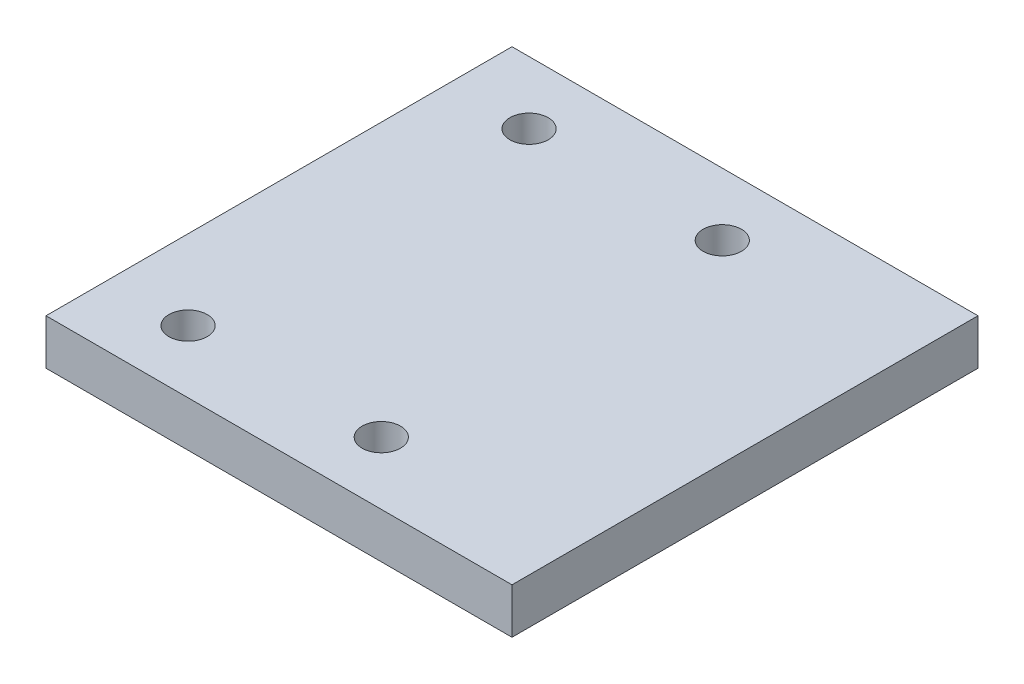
ISO-10303-21;
HEADER;
FILE_DESCRIPTION(('STEP AP214'),'2;1');
FILE_NAME('part.step','',(''),(''),'','','');
FILE_SCHEMA(('AUTOMOTIVE_DESIGN { 1 0 10303 214 1 1 1 1 }'));
ENDSEC;
DATA;
#1=APPLICATION_CONTEXT('core data for automotive mechanical design processes');
#2=APPLICATION_PROTOCOL_DEFINITION('international standard','automotive_design',2000,#1);
#3=PRODUCT_CONTEXT('',#1,'mechanical');
#4=PRODUCT('Part','Part','',(#3));
#5=PRODUCT_RELATED_PRODUCT_CATEGORY('part','',(#4));
#6=PRODUCT_DEFINITION_FORMATION('','',#4);
#7=PRODUCT_DEFINITION_CONTEXT('part definition',#1,'design');
#8=PRODUCT_DEFINITION('design','',#6,#7);
#9=PRODUCT_DEFINITION_SHAPE('','',#8);
#10=(LENGTH_UNIT() NAMED_UNIT(*) SI_UNIT(.MILLI.,.METRE.));
#11=(NAMED_UNIT(*) PLANE_ANGLE_UNIT() SI_UNIT($,.RADIAN.));
#12=(NAMED_UNIT(*) SI_UNIT($,.STERADIAN.) SOLID_ANGLE_UNIT());
#13=UNCERTAINTY_MEASURE_WITH_UNIT(LENGTH_MEASURE(1.E-05),#10,'distance_accuracy_value','');
#14=(GEOMETRIC_REPRESENTATION_CONTEXT(3) GLOBAL_UNCERTAINTY_ASSIGNED_CONTEXT((#13)) GLOBAL_UNIT_ASSIGNED_CONTEXT((#10,
#11,#12)) REPRESENTATION_CONTEXT('',''));
#15=CARTESIAN_POINT('',(0.,0.,0.));
#16=DIRECTION('',(0.,0.,1.));
#17=DIRECTION('',(1.,0.,0.));
#18=AXIS2_PLACEMENT_3D('',#15,#16,#17);
#19=CARTESIAN_POINT('',(-41.,0.,41.));
#20=DIRECTION('',(1.,0.,0.));
#21=DIRECTION('',(0.,0.,-1.));
#22=AXIS2_PLACEMENT_3D('',#19,#20,#21);
#23=PLANE('',#22);
#24=DIRECTION('',(0.,-1.,0.));
#25=VECTOR('',#24,1.);
#26=CARTESIAN_POINT('',(-41.,0.,-41.));
#27=LINE('',#26,#25);
#28=CARTESIAN_POINT('',(-41.,8.,-41.));
#29=VERTEX_POINT('',#28);
#30=CARTESIAN_POINT('',(-41.,0.,-41.));
#31=VERTEX_POINT('',#30);
#32=EDGE_CURVE('E98',#29,#31,#27,.T.);
#33=ORIENTED_EDGE('',*,*,#32,.T.);
#34=DIRECTION('',(0.,0.,-1.));
#35=VECTOR('',#34,1.);
#36=CARTESIAN_POINT('',(-41.,0.,41.));
#37=LINE('',#36,#35);
#38=CARTESIAN_POINT('',(-41.,0.,41.));
#39=VERTEX_POINT('',#38);
#40=EDGE_CURVE('E11',#39,#31,#37,.T.);
#41=ORIENTED_EDGE('',*,*,#40,.F.);
#42=DIRECTION('',(0.,-1.,0.));
#43=VECTOR('',#42,1.);
#44=CARTESIAN_POINT('',(-41.,0.,41.));
#45=LINE('',#44,#43);
#46=CARTESIAN_POINT('',(-41.,8.,41.));
#47=VERTEX_POINT('',#46);
#48=EDGE_CURVE('E86',#47,#39,#45,.T.);
#49=ORIENTED_EDGE('',*,*,#48,.F.);
#50=DIRECTION('',(0.,0.,-1.));
#51=VECTOR('',#50,1.);
#52=CARTESIAN_POINT('',(-41.,8.,41.));
#53=LINE('',#52,#51);
#54=EDGE_CURVE('E94',#47,#29,#53,.T.);
#55=ORIENTED_EDGE('',*,*,#54,.T.);
#56=EDGE_LOOP('',(#33,#41,#49,#55));
#57=FACE_BOUND('',#56,.T.);
#58=ADVANCED_FACE('F35',(#57),#23,.F.);
#59=CARTESIAN_POINT('',(-41.,0.,41.));
#60=DIRECTION('',(0.,1.,0.));
#61=DIRECTION('',(-1.,0.,0.));
#62=AXIS2_PLACEMENT_3D('',#59,#60,#61);
#63=PLANE('',#62);
#64=CARTESIAN_POINT('',(-27.,0.,30.));
#65=DIRECTION('',(0.,1.,0.));
#66=DIRECTION('',(0.,0.,-1.));
#67=AXIS2_PLACEMENT_3D('',#64,#65,#66);
#68=CIRCLE('',#67,3.375);
#69=CARTESIAN_POINT('',(-27.,0.,26.625));
#70=VERTEX_POINT('',#69);
#71=EDGE_CURVE('E127',#70,#70,#68,.T.);
#72=ORIENTED_EDGE('',*,*,#71,.T.);
#73=EDGE_LOOP('',(#72));
#74=FACE_BOUND('',#73,.T.);
#75=CARTESIAN_POINT('',(7.,0.,30.));
#76=DIRECTION('',(0.,1.,0.));
#77=DIRECTION('',(0.,0.,1.));
#78=AXIS2_PLACEMENT_3D('',#75,#76,#77);
#79=CIRCLE('',#78,3.375);
#80=CARTESIAN_POINT('',(7.,0.,33.375));
#81=VERTEX_POINT('',#80);
#82=EDGE_CURVE('E121',#81,#81,#79,.T.);
#83=ORIENTED_EDGE('',*,*,#82,.T.);
#84=EDGE_LOOP('',(#83));
#85=FACE_BOUND('',#84,.T.);
#86=CARTESIAN_POINT('',(7.,0.,-30.));
#87=DIRECTION('',(0.,1.,0.));
#88=DIRECTION('',(0.,0.,-1.));
#89=AXIS2_PLACEMENT_3D('',#86,#87,#88);
#90=CIRCLE('',#89,3.375);
#91=CARTESIAN_POINT('',(7.,0.,-33.375));
#92=VERTEX_POINT('',#91);
#93=EDGE_CURVE('E115',#92,#92,#90,.T.);
#94=ORIENTED_EDGE('',*,*,#93,.T.);
#95=EDGE_LOOP('',(#94));
#96=FACE_BOUND('',#95,.T.);
#97=CARTESIAN_POINT('',(-27.,0.,-30.));
#98=DIRECTION('',(0.,1.,0.));
#99=DIRECTION('',(0.,0.,1.));
#100=AXIS2_PLACEMENT_3D('',#97,#98,#99);
#101=CIRCLE('',#100,3.375);
#102=CARTESIAN_POINT('',(-27.,0.,-26.625));
#103=VERTEX_POINT('',#102);
#104=EDGE_CURVE('E101',#103,#103,#101,.T.);
#105=ORIENTED_EDGE('',*,*,#104,.T.);
#106=EDGE_LOOP('',(#105));
#107=FACE_BOUND('',#106,.T.);
#108=DIRECTION('',(1.,0.,0.));
#109=VECTOR('',#108,1.);
#110=CARTESIAN_POINT('',(-41.,0.,-41.));
#111=LINE('',#110,#109);
#112=CARTESIAN_POINT('',(41.,0.,-41.));
#113=VERTEX_POINT('',#112);
#114=EDGE_CURVE('E90',#31,#113,#111,.T.);
#115=ORIENTED_EDGE('',*,*,#114,.T.);
#116=DIRECTION('',(0.,0.,-1.));
#117=VECTOR('',#116,1.);
#118=CARTESIAN_POINT('',(41.,0.,41.));
#119=LINE('',#118,#117);
#120=CARTESIAN_POINT('',(41.,0.,41.));
#121=VERTEX_POINT('',#120);
#122=EDGE_CURVE('E43',#121,#113,#119,.T.);
#123=ORIENTED_EDGE('',*,*,#122,.F.);
#124=DIRECTION('',(1.,0.,0.));
#125=VECTOR('',#124,1.);
#126=CARTESIAN_POINT('',(-41.,0.,41.));
#127=LINE('',#126,#125);
#128=EDGE_CURVE('E81',#39,#121,#127,.T.);
#129=ORIENTED_EDGE('',*,*,#128,.F.);
#130=ORIENTED_EDGE('',*,*,#40,.T.);
#131=EDGE_LOOP('',(#115,#123,#129,#130));
#132=FACE_BOUND('',#131,.T.);
#133=ADVANCED_FACE('F89',(#74,#85,#96,#107,#132),#63,.F.);
#134=CARTESIAN_POINT('',(41.,0.,41.));
#135=DIRECTION('',(-1.,0.,0.));
#136=DIRECTION('',(0.,0.,1.));
#137=AXIS2_PLACEMENT_3D('',#134,#135,#136);
#138=PLANE('',#137);
#139=DIRECTION('',(0.,1.,0.));
#140=VECTOR('',#139,1.);
#141=CARTESIAN_POINT('',(41.,0.,-41.));
#142=LINE('',#141,#140);
#143=CARTESIAN_POINT('',(41.,8.,-41.));
#144=VERTEX_POINT('',#143);
#145=EDGE_CURVE('E68',#113,#144,#142,.T.);
#146=ORIENTED_EDGE('',*,*,#145,.T.);
#147=DIRECTION('',(0.,0.,-1.));
#148=VECTOR('',#147,1.);
#149=CARTESIAN_POINT('',(41.,8.,41.));
#150=LINE('',#149,#148);
#151=CARTESIAN_POINT('',(41.,8.,41.));
#152=VERTEX_POINT('',#151);
#153=EDGE_CURVE('E91',#152,#144,#150,.T.);
#154=ORIENTED_EDGE('',*,*,#153,.F.);
#155=DIRECTION('',(0.,1.,0.));
#156=VECTOR('',#155,1.);
#157=CARTESIAN_POINT('',(41.,0.,41.));
#158=LINE('',#157,#156);
#159=EDGE_CURVE('E84',#121,#152,#158,.T.);
#160=ORIENTED_EDGE('',*,*,#159,.F.);
#161=ORIENTED_EDGE('',*,*,#122,.T.);
#162=EDGE_LOOP('',(#146,#154,#160,#161));
#163=FACE_BOUND('',#162,.T.);
#164=ADVANCED_FACE('F92',(#163),#138,.F.);
#165=CARTESIAN_POINT('',(-41.,8.,41.));
#166=DIRECTION('',(0.,-1.,0.));
#167=DIRECTION('',(0.,0.,-1.));
#168=AXIS2_PLACEMENT_3D('',#165,#166,#167);
#169=PLANE('',#168);
#170=CARTESIAN_POINT('',(-27.,8.,30.));
#171=DIRECTION('',(0.,1.,0.));
#172=DIRECTION('',(0.,0.,-1.));
#173=AXIS2_PLACEMENT_3D('',#170,#171,#172);
#174=CIRCLE('',#173,3.375);
#175=CARTESIAN_POINT('',(-27.,8.,26.625));
#176=VERTEX_POINT('',#175);
#177=EDGE_CURVE('E130',#176,#176,#174,.T.);
#178=ORIENTED_EDGE('',*,*,#177,.F.);
#179=EDGE_LOOP('',(#178));
#180=FACE_BOUND('',#179,.T.);
#181=CARTESIAN_POINT('',(7.,8.,30.));
#182=DIRECTION('',(0.,1.,0.));
#183=DIRECTION('',(0.,0.,1.));
#184=AXIS2_PLACEMENT_3D('',#181,#182,#183);
#185=CIRCLE('',#184,3.375);
#186=CARTESIAN_POINT('',(7.,8.,33.375));
#187=VERTEX_POINT('',#186);
#188=EDGE_CURVE('E124',#187,#187,#185,.T.);
#189=ORIENTED_EDGE('',*,*,#188,.F.);
#190=EDGE_LOOP('',(#189));
#191=FACE_BOUND('',#190,.T.);
#192=CARTESIAN_POINT('',(7.,8.,-30.));
#193=DIRECTION('',(0.,1.,0.));
#194=DIRECTION('',(0.,0.,-1.));
#195=AXIS2_PLACEMENT_3D('',#192,#193,#194);
#196=CIRCLE('',#195,3.375);
#197=CARTESIAN_POINT('',(7.,8.,-33.375));
#198=VERTEX_POINT('',#197);
#199=EDGE_CURVE('E118',#198,#198,#196,.T.);
#200=ORIENTED_EDGE('',*,*,#199,.F.);
#201=EDGE_LOOP('',(#200));
#202=FACE_BOUND('',#201,.T.);
#203=CARTESIAN_POINT('',(-27.,8.,-30.));
#204=DIRECTION('',(0.,1.,0.));
#205=DIRECTION('',(0.,0.,1.));
#206=AXIS2_PLACEMENT_3D('',#203,#204,#205);
#207=CIRCLE('',#206,3.375);
#208=CARTESIAN_POINT('',(-27.,8.,-26.625));
#209=VERTEX_POINT('',#208);
#210=EDGE_CURVE('E112',#209,#209,#207,.T.);
#211=ORIENTED_EDGE('',*,*,#210,.F.);
#212=EDGE_LOOP('',(#211));
#213=FACE_BOUND('',#212,.T.);
#214=DIRECTION('',(-1.,0.,0.));
#215=VECTOR('',#214,1.);
#216=CARTESIAN_POINT('',(-41.,8.,-41.));
#217=LINE('',#216,#215);
#218=EDGE_CURVE('E74',#144,#29,#217,.T.);
#219=ORIENTED_EDGE('',*,*,#218,.T.);
#220=ORIENTED_EDGE('',*,*,#54,.F.);
#221=DIRECTION('',(-1.,0.,0.));
#222=VECTOR('',#221,1.);
#223=CARTESIAN_POINT('',(-41.,8.,41.));
#224=LINE('',#223,#222);
#225=EDGE_CURVE('E51',#152,#47,#224,.T.);
#226=ORIENTED_EDGE('',*,*,#225,.F.);
#227=ORIENTED_EDGE('',*,*,#153,.T.);
#228=EDGE_LOOP('',(#219,#220,#226,#227));
#229=FACE_BOUND('',#228,.T.);
#230=ADVANCED_FACE('F106',(#180,#191,#202,#213,#229),#169,.F.);
#231=CARTESIAN_POINT('',(-41.,8.,41.));
#232=DIRECTION('',(0.,0.,-1.));
#233=DIRECTION('',(-1.,0.,0.));
#234=AXIS2_PLACEMENT_3D('',#231,#232,#233);
#235=PLANE('',#234);
#236=ORIENTED_EDGE('',*,*,#48,.T.);
#237=ORIENTED_EDGE('',*,*,#128,.T.);
#238=ORIENTED_EDGE('',*,*,#159,.T.);
#239=ORIENTED_EDGE('',*,*,#225,.T.);
#240=EDGE_LOOP('',(#236,#237,#238,#239));
#241=FACE_BOUND('',#240,.T.);
#242=ADVANCED_FACE('F82',(#241),#235,.F.);
#243=CARTESIAN_POINT('',(-41.,8.,-41.));
#244=DIRECTION('',(0.,0.,-1.));
#245=DIRECTION('',(-1.,0.,0.));
#246=AXIS2_PLACEMENT_3D('',#243,#244,#245);
#247=PLANE('',#246);
#248=ORIENTED_EDGE('',*,*,#32,.F.);
#249=ORIENTED_EDGE('',*,*,#218,.F.);
#250=ORIENTED_EDGE('',*,*,#145,.F.);
#251=ORIENTED_EDGE('',*,*,#114,.F.);
#252=EDGE_LOOP('',(#248,#249,#250,#251));
#253=FACE_BOUND('',#252,.T.);
#254=ADVANCED_FACE('F109',(#253),#247,.T.);
#255=CARTESIAN_POINT('',(-27.,0.,-30.));
#256=DIRECTION('',(0.,1.,0.));
#257=DIRECTION('',(0.,0.,1.));
#258=AXIS2_PLACEMENT_3D('',#255,#256,#257);
#259=CYLINDRICAL_SURFACE('',#258,3.375);
#260=ORIENTED_EDGE('',*,*,#104,.F.);
#261=EDGE_LOOP('',(#260));
#262=FACE_BOUND('',#261,.T.);
#263=ORIENTED_EDGE('',*,*,#210,.T.);
#264=EDGE_LOOP('',(#263));
#265=FACE_BOUND('',#264,.T.);
#266=ADVANCED_FACE('F154',(#262,#265),#259,.F.);
#267=CARTESIAN_POINT('',(7.,0.,-30.));
#268=DIRECTION('',(0.,1.,0.));
#269=DIRECTION('',(0.,0.,1.));
#270=AXIS2_PLACEMENT_3D('',#267,#268,#269);
#271=CYLINDRICAL_SURFACE('',#270,3.375);
#272=ORIENTED_EDGE('',*,*,#93,.F.);
#273=EDGE_LOOP('',(#272));
#274=FACE_BOUND('',#273,.T.);
#275=ORIENTED_EDGE('',*,*,#199,.T.);
#276=EDGE_LOOP('',(#275));
#277=FACE_BOUND('',#276,.T.);
#278=ADVANCED_FACE('F156',(#274,#277),#271,.F.);
#279=CARTESIAN_POINT('',(7.,0.,30.));
#280=DIRECTION('',(0.,1.,0.));
#281=DIRECTION('',(0.,0.,1.));
#282=AXIS2_PLACEMENT_3D('',#279,#280,#281);
#283=CYLINDRICAL_SURFACE('',#282,3.375);
#284=ORIENTED_EDGE('',*,*,#82,.F.);
#285=EDGE_LOOP('',(#284));
#286=FACE_BOUND('',#285,.T.);
#287=ORIENTED_EDGE('',*,*,#188,.T.);
#288=EDGE_LOOP('',(#287));
#289=FACE_BOUND('',#288,.T.);
#290=ADVANCED_FACE('F141',(#286,#289),#283,.F.);
#291=CARTESIAN_POINT('',(-27.,0.,30.));
#292=DIRECTION('',(0.,1.,0.));
#293=DIRECTION('',(0.,0.,1.));
#294=AXIS2_PLACEMENT_3D('',#291,#292,#293);
#295=CYLINDRICAL_SURFACE('',#294,3.375);
#296=ORIENTED_EDGE('',*,*,#71,.F.);
#297=EDGE_LOOP('',(#296));
#298=FACE_BOUND('',#297,.T.);
#299=ORIENTED_EDGE('',*,*,#177,.T.);
#300=EDGE_LOOP('',(#299));
#301=FACE_BOUND('',#300,.T.);
#302=ADVANCED_FACE('F138',(#298,#301),#295,.F.);
#303=CLOSED_SHELL('',(#58,#133,#164,#230,#242,#254,#266,#278,#290,#302));
#304=MANIFOLD_SOLID_BREP('B2',#303);
#305=ADVANCED_BREP_SHAPE_REPRESENTATION('',(#18,#304),#14);
#306=SHAPE_DEFINITION_REPRESENTATION(#9,#305);
ENDSEC;
END-ISO-10303-21;
